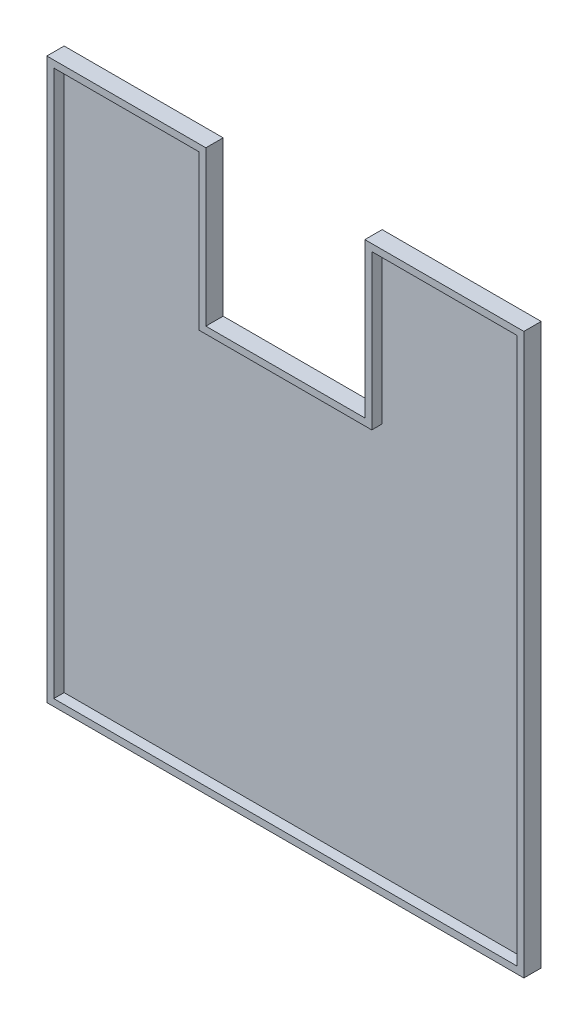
from build123d import *

# Parameters (mm, degrees)
BOSS_EXTRUDE1_DEPTH      = 2
BOSS_EXTRUDE2_DEPTH      = 3
BOSS_EXTRUDE2_DEPTH_BACK = 2


with BuildPart() as part:
    # Sketch1 → Boss-Extrude1 (new body)
    with BuildSketch(Plane.XY):
        Polygon((-25, 79), (-25, 34.510337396), (25, 34.510337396), (25, 79), (67, 79), (67, -79), (-67, -79), (-67, 79), align=None)
    extrude(amount=BOSS_EXTRUDE1_DEPTH)

    # Sketch3 → Boss-Extrude2 (add, two sides: drawn at the far end of the back side and taken through both)
    with BuildSketch(Plane.XY.offset(2).offset(-BOSS_EXTRUDE2_DEPTH_BACK)):
        Polygon((-27, 81), (-69, 81), (-69, -81), (69, -81), (69, 81), (23, 81), (23, 36.311907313), (-23, 36.311907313), (-23, 81), align=None)
        Polygon((-25, 79), (-67, 79), (-67, -79), (67, -79), (67, 79), (25, 79), (25, 34.510337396), (25, 34.311907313), (-25, 34.311907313), (-25, 34.510337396), align=None, mode=Mode.SUBTRACT)
    extrude(amount=BOSS_EXTRUDE2_DEPTH + BOSS_EXTRUDE2_DEPTH_BACK)


solid = part.part
